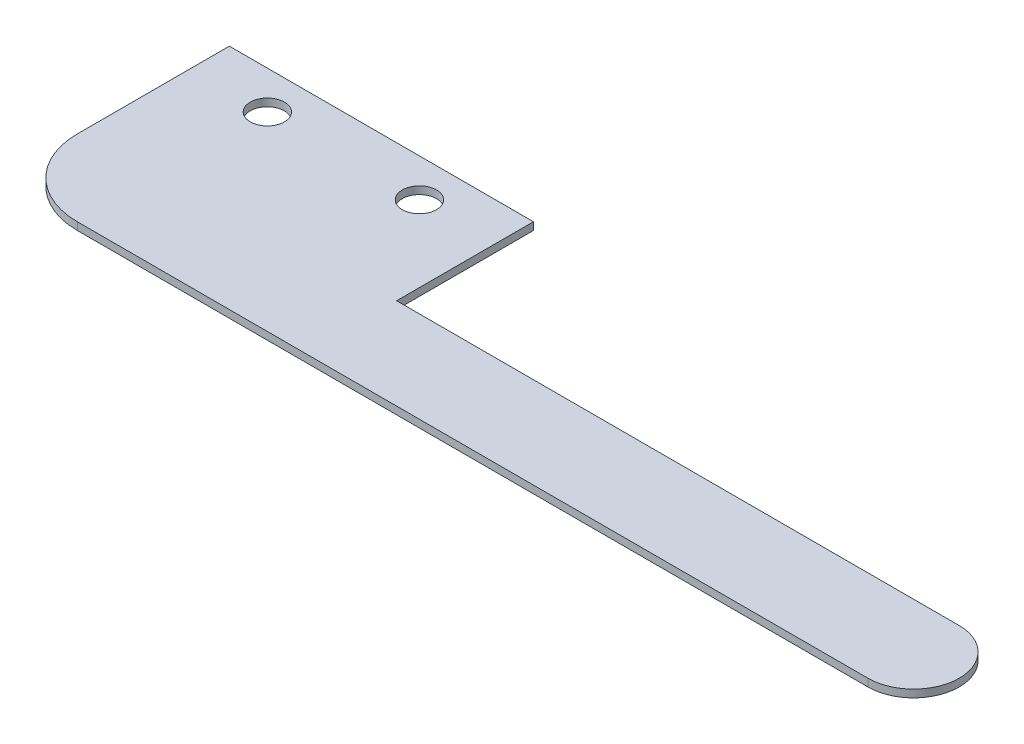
from build123d import *

# Parameters (mm, degrees)
SKETCH1_R      = 2.25
EXTRUDE1_DEPTH = 1


with BuildPart() as part:
    # Sketch1 → Extrude1 (new body)
    with BuildSketch(Plane(origin=(0, 0, 0), x_dir=(1, 0, 0), z_dir=(0, 1, 0))):
        with BuildLine():
            Line((0, 10), (0, 30))
            Line((0, 30), (40, 30))
            Line((40, 30), (40, 12))
            Line((40, 12), (114, 12))
            ThreePointArc((114, 12), (120, 6), (114, 0))
            Line((114, 0), (10, 0))
            ThreePointArc((10, 0), (2.928932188, 2.928932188), (0, 10))
        make_face()
        with Locations(Location((10, 25, 0), (0, 0, 270))):
            Circle(SKETCH1_R, mode=Mode.SUBTRACT)
        with Locations(Location((30, 25, 0), (0, 0, 270))):
            Circle(SKETCH1_R, mode=Mode.SUBTRACT)
    extrude(amount=EXTRUDE1_DEPTH)


solid = part.part
